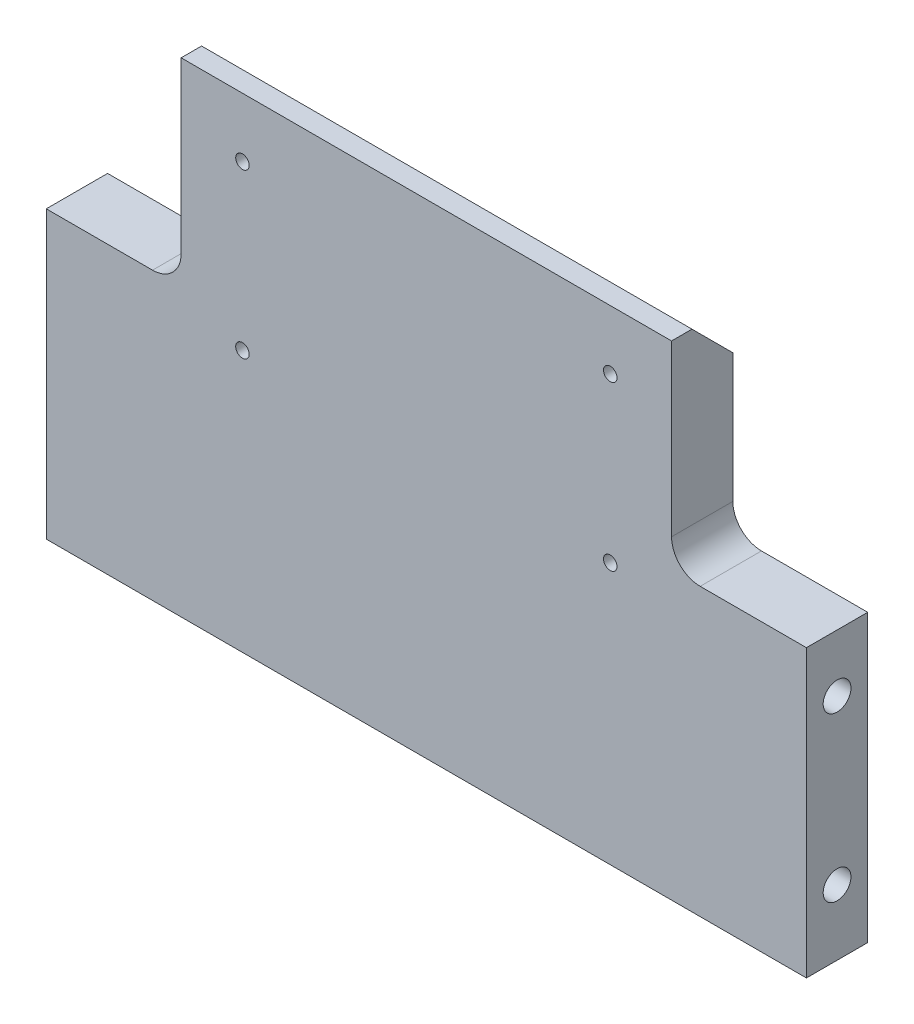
from build123d import *

# Parameters (mm, degrees)
ESQUISSE1_W                = 186
ESQUISSE1_H                = 130
BASE_EXTRUSION_DEPTH       = 15
ESQUISSE2_W                = 33
ESQUISSE2_H                = 60
ENL_V_MAT_EXTRU_1_DEPTH    = 15
TROU_TARAUD_M8X1_251_D     = 6.8
TROU_TARAUD_M8X1_251_DEPTH = 46.25
TROU_TARAUD_M8X1_251_TIP   = 2.042926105
TROU_TARAUD_M8X1_252_D     = 6.8
TROU_TARAUD_M8X1_252_DEPTH = 46.25
TROU_TARAUD_M8X1_252_TIP   = 2.042926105
CONG_1_R                   = 7
TROU_TARAUD_M4X0_71_D      = 3.3
ESQUISSE12_W               = 120
ESQUISSE12_H               = 11.5
ENL_V_MAT_EXTRU_5_DEPTH    = 40
CHANFREIN1_SIZE            = 10


with BuildPart() as part:
    # Esquisse1 → Base-Extrusion (new body)
    with BuildSketch(Plane.XY):
        with Locations((8.673407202, -12.448891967)):
            Rectangle(ESQUISSE1_W, ESQUISSE1_H)
    extrude(amount=BASE_EXTRUSION_DEPTH)

    # Esquisse2 → Enl_v. mat.-Extru.1 (cut)
    with BuildSketch(Plane.XY.offset(15)):
        with Locations((-67.826592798, 22.551108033)):
            Rectangle(ESQUISSE2_W, ESQUISSE2_H)
        with Locations((85.173407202, 22.551108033)):
            Rectangle(ESQUISSE2_W, ESQUISSE2_H)
    extrude(amount=-ENL_V_MAT_EXTRU_1_DEPTH, mode=Mode.SUBTRACT)

    # Trou taraud_ M8x1.251
    with Locations(Plane.ZY.offset(84.326592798)):
        with Locations((7.5, -61.448891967), (7.5, -21.448891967)):
            Hole(TROU_TARAUD_M8X1_251_D / 2, depth=TROU_TARAUD_M8X1_251_DEPTH)
            with Locations((0, 0, -(TROU_TARAUD_M8X1_251_DEPTH + TROU_TARAUD_M8X1_251_TIP / 2))):  # 118° drill point
                Cone(0, TROU_TARAUD_M8X1_251_D / 2, TROU_TARAUD_M8X1_251_TIP, mode=Mode.SUBTRACT)

    # Trou taraud_ M8x1.252
    with Locations(Plane(origin=(101.673407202, 0, 0), x_dir=(0, 0, -1), z_dir=(1, 0, 0))):
        with Locations((-7.5, -61.448891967), (-7.5, -21.448891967)):
            Hole(TROU_TARAUD_M8X1_252_D / 2, depth=TROU_TARAUD_M8X1_252_DEPTH)
            with Locations((0, 0, -(TROU_TARAUD_M8X1_252_DEPTH + TROU_TARAUD_M8X1_252_TIP / 2))):  # 118° drill point
                Cone(0, TROU_TARAUD_M8X1_252_D / 2, TROU_TARAUD_M8X1_252_TIP, mode=Mode.SUBTRACT)

    # Cong_1
    cong_1_edges = [part.edges().sort_by_distance(p)[0] for p in [
        (-51.326592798, -7.448891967, 7.5),
        (68.673407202, -7.448891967, 7.5),
    ]]
    fillet(cong_1_edges, radius=CONG_1_R)

    # Trou taraud_ M4x0.71 (through all)
    with Locations(Plane.XY.offset(15)):
        with Locations((-36.326592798, 26.551108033), (53.673407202, 26.551108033), (53.673407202, -13.448891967), (-36.326592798, -13.448891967)):
            Hole(TROU_TARAUD_M4X0_71_D / 2)

    # Esquisse12 → Enl_v. mat.-Extru.5 (cut)
    with BuildSketch(Plane.XY.offset(15)):
        with Locations((8.673407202, 46.801108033)):
            Rectangle(ESQUISSE12_W, ESQUISSE12_H)
    extrude(amount=-ENL_V_MAT_EXTRU_5_DEPTH, mode=Mode.SUBTRACT)

    # Chanfrein1
    chanfrein1_edges = [part.edges().sort_by_distance(p)[0] for p in [
        (8.673407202, 41.051108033, 0),
    ]]
    chamfer(chanfrein1_edges, length=CHANFREIN1_SIZE)


solid = part.part
